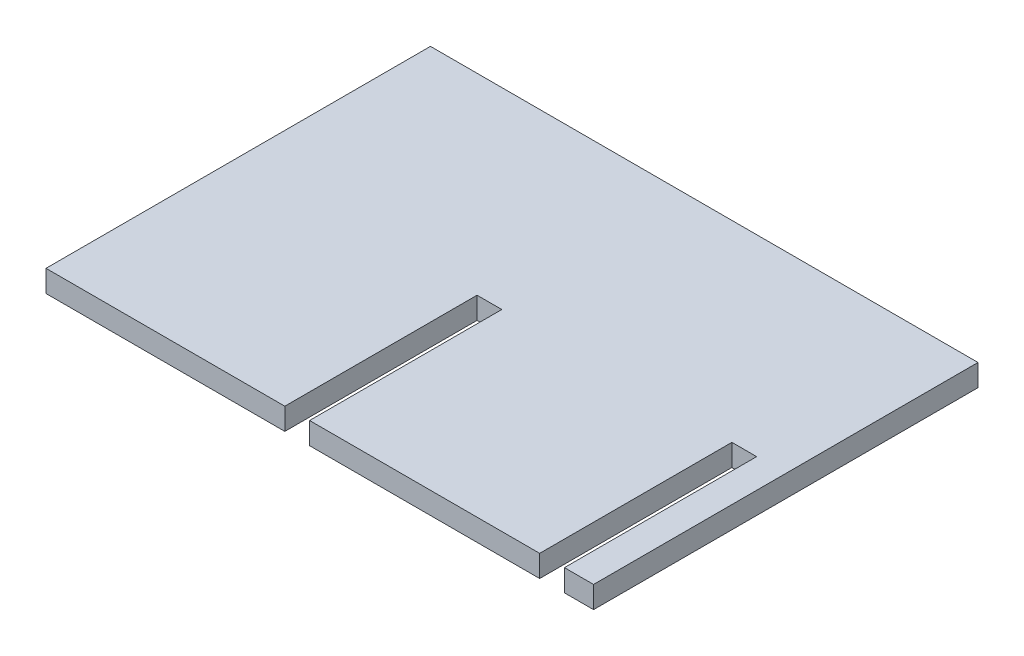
ISO-10303-21;
HEADER;
FILE_DESCRIPTION(('STEP AP214'),'2;1');
FILE_NAME('part.step','',(''),(''),'','','');
FILE_SCHEMA(('AUTOMOTIVE_DESIGN { 1 0 10303 214 1 1 1 1 }'));
ENDSEC;
DATA;
#1=APPLICATION_CONTEXT('core data for automotive mechanical design processes');
#2=APPLICATION_PROTOCOL_DEFINITION('international standard','automotive_design',2000,#1);
#3=PRODUCT_CONTEXT('',#1,'mechanical');
#4=PRODUCT('Part','Part','',(#3));
#5=PRODUCT_RELATED_PRODUCT_CATEGORY('part','',(#4));
#6=PRODUCT_DEFINITION_FORMATION('','',#4);
#7=PRODUCT_DEFINITION_CONTEXT('part definition',#1,'design');
#8=PRODUCT_DEFINITION('design','',#6,#7);
#9=PRODUCT_DEFINITION_SHAPE('','',#8);
#10=(LENGTH_UNIT() NAMED_UNIT(*) SI_UNIT(.MILLI.,.METRE.));
#11=(NAMED_UNIT(*) PLANE_ANGLE_UNIT() SI_UNIT($,.RADIAN.));
#12=(NAMED_UNIT(*) SI_UNIT($,.STERADIAN.) SOLID_ANGLE_UNIT());
#13=UNCERTAINTY_MEASURE_WITH_UNIT(LENGTH_MEASURE(1.E-05),#10,'distance_accuracy_value','');
#14=(GEOMETRIC_REPRESENTATION_CONTEXT(3) GLOBAL_UNCERTAINTY_ASSIGNED_CONTEXT((#13)) GLOBAL_UNIT_ASSIGNED_CONTEXT((#10,
#11,#12)) REPRESENTATION_CONTEXT('',''));
#15=CARTESIAN_POINT('',(0.,0.,0.));
#16=DIRECTION('',(0.,0.,1.));
#17=DIRECTION('',(1.,0.,0.));
#18=AXIS2_PLACEMENT_3D('',#15,#16,#17);
#19=CARTESIAN_POINT('',(0.,0.,26.4));
#20=DIRECTION('',(0.,0.,-1.));
#21=DIRECTION('',(-1.,0.,0.));
#22=AXIS2_PLACEMENT_3D('',#19,#20,#21);
#23=PLANE('',#22);
#24=DIRECTION('',(1.,0.,0.));
#25=VECTOR('',#24,1.);
#26=CARTESIAN_POINT('',(-34.75,-20.75,26.4));
#27=LINE('',#26,#25);
#28=CARTESIAN_POINT('',(0.849999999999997,-20.75,26.4));
#29=VERTEX_POINT('',#28);
#30=CARTESIAN_POINT('',(2.85000000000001,-20.75,26.4));
#31=VERTEX_POINT('',#30);
#32=EDGE_CURVE('E136',#29,#31,#27,.T.);
#33=ORIENTED_EDGE('',*,*,#32,.T.);
#34=DIRECTION('',(0.,-1.,0.));
#35=VECTOR('',#34,1.);
#36=CARTESIAN_POINT('',(2.85000000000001,22.1573664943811,26.4));
#37=LINE('',#36,#35);
#38=CARTESIAN_POINT('',(2.85000000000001,-19.25,26.4));
#39=VERTEX_POINT('',#38);
#40=EDGE_CURVE('E122',#39,#31,#37,.T.);
#41=ORIENTED_EDGE('',*,*,#40,.F.);
#42=DIRECTION('',(-1.,0.,0.));
#43=VECTOR('',#42,1.);
#44=CARTESIAN_POINT('',(-34.75,-19.25,26.4));
#45=LINE('',#44,#43);
#46=CARTESIAN_POINT('',(0.849999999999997,-19.25,26.4));
#47=VERTEX_POINT('',#46);
#48=EDGE_CURVE('E149',#39,#47,#45,.T.);
#49=ORIENTED_EDGE('',*,*,#48,.T.);
#50=DIRECTION('',(0.,-1.,0.));
#51=VECTOR('',#50,1.);
#52=CARTESIAN_POINT('',(0.849999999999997,-5.94098050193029,26.4));
#53=LINE('',#52,#51);
#54=EDGE_CURVE('E143',#47,#29,#53,.T.);
#55=ORIENTED_EDGE('',*,*,#54,.T.);
#56=EDGE_LOOP('',(#33,#41,#49,#55));
#57=FACE_BOUND('',#56,.T.);
#58=ADVANCED_FACE('F34',(#57),#23,.F.);
#59=CARTESIAN_POINT('',(-16.65,-20.75,26.4));
#60=VERTEX_POINT('',#59);
#61=CARTESIAN_POINT('',(-0.850000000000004,-20.75,26.4));
#62=VERTEX_POINT('',#61);
#63=EDGE_CURVE('E144',#60,#62,#27,.T.);
#64=ORIENTED_EDGE('',*,*,#63,.T.);
#65=DIRECTION('',(0.,-1.,0.));
#66=VECTOR('',#65,1.);
#67=CARTESIAN_POINT('',(-0.850000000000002,-5.94098050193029,26.4));
#68=LINE('',#67,#66);
#69=CARTESIAN_POINT('',(-0.850000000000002,-19.25,26.4));
#70=VERTEX_POINT('',#69);
#71=EDGE_CURVE('E57',#70,#62,#68,.T.);
#72=ORIENTED_EDGE('',*,*,#71,.F.);
#73=CARTESIAN_POINT('',(-16.65,-19.25,26.4));
#74=VERTEX_POINT('',#73);
#75=EDGE_CURVE('E195',#70,#74,#45,.T.);
#76=ORIENTED_EDGE('',*,*,#75,.T.);
#77=DIRECTION('',(0.,-1.,0.));
#78=VECTOR('',#77,1.);
#79=CARTESIAN_POINT('',(-16.65,-5.94098050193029,26.4));
#80=LINE('',#79,#78);
#81=EDGE_CURVE('E186',#74,#60,#80,.T.);
#82=ORIENTED_EDGE('',*,*,#81,.T.);
#83=EDGE_LOOP('',(#64,#72,#76,#82));
#84=FACE_BOUND('',#83,.T.);
#85=ADVANCED_FACE('F204',(#84),#23,.F.);
#86=CARTESIAN_POINT('',(-34.75,-19.25,26.4));
#87=DIRECTION('',(0.,-1.,0.));
#88=DIRECTION('',(0.,0.,-1.));
#89=AXIS2_PLACEMENT_3D('',#86,#87,#88);
#90=PLANE('',#89);
#91=ORIENTED_EDGE('',*,*,#48,.F.);
#92=DIRECTION('',(0.,0.,1.));
#93=VECTOR('',#92,1.);
#94=CARTESIAN_POINT('',(2.85000000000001,-19.25,26.4));
#95=LINE('',#94,#93);
#96=CARTESIAN_POINT('',(2.85000000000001,-19.25,0.));
#97=VERTEX_POINT('',#96);
#98=EDGE_CURVE('E125',#97,#39,#95,.T.);
#99=ORIENTED_EDGE('',*,*,#98,.F.);
#100=DIRECTION('',(-1.,0.,0.));
#101=VECTOR('',#100,1.);
#102=CARTESIAN_POINT('',(-34.75,-19.25,0.));
#103=LINE('',#102,#101);
#104=CARTESIAN_POINT('',(-34.75,-19.25,0.));
#105=VERTEX_POINT('',#104);
#106=EDGE_CURVE('E161',#97,#105,#103,.T.);
#107=ORIENTED_EDGE('',*,*,#106,.T.);
#108=DIRECTION('',(0.,0.,-1.));
#109=VECTOR('',#108,1.);
#110=CARTESIAN_POINT('',(-34.75,-19.25,26.4));
#111=LINE('',#110,#109);
#112=CARTESIAN_POINT('',(-34.75,-19.25,26.4));
#113=VERTEX_POINT('',#112);
#114=EDGE_CURVE('E11',#113,#105,#111,.T.);
#115=ORIENTED_EDGE('',*,*,#114,.F.);
#116=CARTESIAN_POINT('',(-18.35,-19.25,26.4));
#117=VERTEX_POINT('',#116);
#118=EDGE_CURVE('E159',#117,#113,#45,.T.);
#119=ORIENTED_EDGE('',*,*,#118,.F.);
#120=DIRECTION('',(0.,0.,1.));
#121=VECTOR('',#120,1.);
#122=CARTESIAN_POINT('',(-18.35,-19.25,13.2));
#123=LINE('',#122,#121);
#124=CARTESIAN_POINT('',(-18.35,-19.25,13.2));
#125=VERTEX_POINT('',#124);
#126=EDGE_CURVE('E173',#125,#117,#123,.T.);
#127=ORIENTED_EDGE('',*,*,#126,.F.);
#128=DIRECTION('',(-1.,0.,0.));
#129=VECTOR('',#128,1.);
#130=CARTESIAN_POINT('',(-18.35,-19.25,13.2));
#131=LINE('',#130,#129);
#132=CARTESIAN_POINT('',(-16.65,-19.25,13.2));
#133=VERTEX_POINT('',#132);
#134=EDGE_CURVE('E167',#133,#125,#131,.T.);
#135=ORIENTED_EDGE('',*,*,#134,.F.);
#136=DIRECTION('',(0.,0.,-1.));
#137=VECTOR('',#136,1.);
#138=CARTESIAN_POINT('',(-16.65,-19.25,13.2));
#139=LINE('',#138,#137);
#140=EDGE_CURVE('E162',#74,#133,#139,.T.);
#141=ORIENTED_EDGE('',*,*,#140,.F.);
#142=ORIENTED_EDGE('',*,*,#75,.F.);
#143=DIRECTION('',(0.,0.,1.));
#144=VECTOR('',#143,1.);
#145=CARTESIAN_POINT('',(-0.850000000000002,-19.25,26.4));
#146=LINE('',#145,#144);
#147=CARTESIAN_POINT('',(-0.85,-19.25,13.2));
#148=VERTEX_POINT('',#147);
#149=EDGE_CURVE('E325',#148,#70,#146,.T.);
#150=ORIENTED_EDGE('',*,*,#149,.F.);
#151=DIRECTION('',(-1.,0.,0.));
#152=VECTOR('',#151,1.);
#153=CARTESIAN_POINT('',(0.85,-19.25,13.2));
#154=LINE('',#153,#152);
#155=CARTESIAN_POINT('',(0.85,-19.25,13.2));
#156=VERTEX_POINT('',#155);
#157=EDGE_CURVE('E329',#156,#148,#154,.T.);
#158=ORIENTED_EDGE('',*,*,#157,.F.);
#159=DIRECTION('',(0.,0.,-1.));
#160=VECTOR('',#159,1.);
#161=CARTESIAN_POINT('',(0.849999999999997,-19.25,26.4));
#162=LINE('',#161,#160);
#163=EDGE_CURVE('E180',#47,#156,#162,.T.);
#164=ORIENTED_EDGE('',*,*,#163,.F.);
#165=EDGE_LOOP('',(#91,#99,#107,#115,#119,#127,#135,#141,#142,#150,#158,#164));
#166=FACE_BOUND('',#165,.T.);
#167=ADVANCED_FACE('F36',(#166),#90,.F.);
#168=CARTESIAN_POINT('',(-34.75,-19.25,26.4));
#169=DIRECTION('',(1.,0.,0.));
#170=DIRECTION('',(0.,0.,-1.));
#171=AXIS2_PLACEMENT_3D('',#168,#169,#170);
#172=PLANE('',#171);
#173=DIRECTION('',(0.,-1.,0.));
#174=VECTOR('',#173,1.);
#175=CARTESIAN_POINT('',(-34.75,-19.25,0.));
#176=LINE('',#175,#174);
#177=CARTESIAN_POINT('',(-34.75,-20.75,0.));
#178=VERTEX_POINT('',#177);
#179=EDGE_CURVE('E160',#105,#178,#176,.T.);
#180=ORIENTED_EDGE('',*,*,#179,.T.);
#181=DIRECTION('',(0.,0.,-1.));
#182=VECTOR('',#181,1.);
#183=CARTESIAN_POINT('',(-34.75,-20.75,26.4));
#184=LINE('',#183,#182);
#185=CARTESIAN_POINT('',(-34.75,-20.75,26.4));
#186=VERTEX_POINT('',#185);
#187=EDGE_CURVE('E42',#186,#178,#184,.T.);
#188=ORIENTED_EDGE('',*,*,#187,.F.);
#189=DIRECTION('',(0.,-1.,0.));
#190=VECTOR('',#189,1.);
#191=CARTESIAN_POINT('',(-34.75,-19.25,26.4));
#192=LINE('',#191,#190);
#193=EDGE_CURVE('E145',#113,#186,#192,.T.);
#194=ORIENTED_EDGE('',*,*,#193,.F.);
#195=ORIENTED_EDGE('',*,*,#114,.T.);
#196=EDGE_LOOP('',(#180,#188,#194,#195));
#197=FACE_BOUND('',#196,.T.);
#198=ADVANCED_FACE('F201',(#197),#172,.F.);
#199=CARTESIAN_POINT('',(-34.75,-20.75,26.4));
#200=DIRECTION('',(0.,1.,0.));
#201=DIRECTION('',(0.,0.,1.));
#202=AXIS2_PLACEMENT_3D('',#199,#200,#201);
#203=PLANE('',#202);
#204=DIRECTION('',(1.,0.,0.));
#205=VECTOR('',#204,1.);
#206=CARTESIAN_POINT('',(-34.75,-20.75,0.));
#207=LINE('',#206,#205);
#208=CARTESIAN_POINT('',(2.85000000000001,-20.75,0.));
#209=VERTEX_POINT('',#208);
#210=EDGE_CURVE('E139',#178,#209,#207,.T.);
#211=ORIENTED_EDGE('',*,*,#210,.T.);
#212=DIRECTION('',(0.,0.,-1.));
#213=VECTOR('',#212,1.);
#214=CARTESIAN_POINT('',(2.85000000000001,-20.75,26.4));
#215=LINE('',#214,#213);
#216=EDGE_CURVE('E49',#31,#209,#215,.T.);
#217=ORIENTED_EDGE('',*,*,#216,.F.);
#218=ORIENTED_EDGE('',*,*,#32,.F.);
#219=DIRECTION('',(0.,0.,1.));
#220=VECTOR('',#219,1.);
#221=CARTESIAN_POINT('',(0.849999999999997,-20.75,26.4));
#222=LINE('',#221,#220);
#223=CARTESIAN_POINT('',(0.85,-20.75,13.2));
#224=VERTEX_POINT('',#223);
#225=EDGE_CURVE('E343',#224,#29,#222,.T.);
#226=ORIENTED_EDGE('',*,*,#225,.F.);
#227=DIRECTION('',(1.,0.,0.));
#228=VECTOR('',#227,1.);
#229=CARTESIAN_POINT('',(0.85,-20.75,13.2));
#230=LINE('',#229,#228);
#231=CARTESIAN_POINT('',(-0.85,-20.75,13.2));
#232=VERTEX_POINT('',#231);
#233=EDGE_CURVE('E342',#232,#224,#230,.T.);
#234=ORIENTED_EDGE('',*,*,#233,.F.);
#235=DIRECTION('',(0.,0.,-1.));
#236=VECTOR('',#235,1.);
#237=CARTESIAN_POINT('',(-0.850000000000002,-20.75,26.4));
#238=LINE('',#237,#236);
#239=EDGE_CURVE('E340',#62,#232,#238,.T.);
#240=ORIENTED_EDGE('',*,*,#239,.F.);
#241=ORIENTED_EDGE('',*,*,#63,.F.);
#242=DIRECTION('',(0.,0.,1.));
#243=VECTOR('',#242,1.);
#244=CARTESIAN_POINT('',(-16.65,-20.75,13.2));
#245=LINE('',#244,#243);
#246=CARTESIAN_POINT('',(-16.65,-20.75,13.2));
#247=VERTEX_POINT('',#246);
#248=EDGE_CURVE('E177',#247,#60,#245,.T.);
#249=ORIENTED_EDGE('',*,*,#248,.F.);
#250=DIRECTION('',(1.,0.,0.));
#251=VECTOR('',#250,1.);
#252=CARTESIAN_POINT('',(-18.35,-20.75,13.2));
#253=LINE('',#252,#251);
#254=CARTESIAN_POINT('',(-18.35,-20.75,13.2));
#255=VERTEX_POINT('',#254);
#256=EDGE_CURVE('E183',#255,#247,#253,.T.);
#257=ORIENTED_EDGE('',*,*,#256,.F.);
#258=DIRECTION('',(0.,0.,-1.));
#259=VECTOR('',#258,1.);
#260=CARTESIAN_POINT('',(-18.35,-20.75,13.2));
#261=LINE('',#260,#259);
#262=CARTESIAN_POINT('',(-18.35,-20.75,26.4));
#263=VERTEX_POINT('',#262);
#264=EDGE_CURVE('E179',#263,#255,#261,.T.);
#265=ORIENTED_EDGE('',*,*,#264,.F.);
#266=EDGE_CURVE('E147',#186,#263,#27,.T.);
#267=ORIENTED_EDGE('',*,*,#266,.F.);
#268=ORIENTED_EDGE('',*,*,#187,.T.);
#269=EDGE_LOOP('',(#211,#217,#218,#226,#234,#240,#241,#249,#257,#265,#267,#268));
#270=FACE_BOUND('',#269,.T.);
#271=ADVANCED_FACE('F134',(#270),#203,.F.);
#272=ORIENTED_EDGE('',*,*,#266,.T.);
#273=DIRECTION('',(0.,-1.,0.));
#274=VECTOR('',#273,1.);
#275=CARTESIAN_POINT('',(-18.35,-5.94098050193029,26.4));
#276=LINE('',#275,#274);
#277=EDGE_CURVE('E191',#117,#263,#276,.T.);
#278=ORIENTED_EDGE('',*,*,#277,.F.);
#279=ORIENTED_EDGE('',*,*,#118,.T.);
#280=ORIENTED_EDGE('',*,*,#193,.T.);
#281=EDGE_LOOP('',(#272,#278,#279,#280));
#282=FACE_BOUND('',#281,.T.);
#283=ADVANCED_FACE('F198',(#282),#23,.F.);
#284=CARTESIAN_POINT('',(0.,0.,0.));
#285=DIRECTION('',(0.,0.,-1.));
#286=DIRECTION('',(-1.,0.,0.));
#287=AXIS2_PLACEMENT_3D('',#284,#285,#286);
#288=PLANE('',#287);
#289=DIRECTION('',(0.,-1.,0.));
#290=VECTOR('',#289,1.);
#291=CARTESIAN_POINT('',(2.85000000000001,22.1573664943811,0.));
#292=LINE('',#291,#290);
#293=EDGE_CURVE('E129',#97,#209,#292,.T.);
#294=ORIENTED_EDGE('',*,*,#293,.T.);
#295=ORIENTED_EDGE('',*,*,#210,.F.);
#296=ORIENTED_EDGE('',*,*,#179,.F.);
#297=ORIENTED_EDGE('',*,*,#106,.F.);
#298=EDGE_LOOP('',(#294,#295,#296,#297));
#299=FACE_BOUND('',#298,.T.);
#300=ADVANCED_FACE('F217',(#299),#288,.T.);
#301=CARTESIAN_POINT('',(-16.65,-5.94098050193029,13.2));
#302=DIRECTION('',(1.,0.,0.));
#303=DIRECTION('',(0.,0.,-1.));
#304=AXIS2_PLACEMENT_3D('',#301,#302,#303);
#305=PLANE('',#304);
#306=ORIENTED_EDGE('',*,*,#140,.T.);
#307=DIRECTION('',(0.,-1.,0.));
#308=VECTOR('',#307,1.);
#309=CARTESIAN_POINT('',(-16.65,-5.94098050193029,13.2));
#310=LINE('',#309,#308);
#311=EDGE_CURVE('E187',#133,#247,#310,.T.);
#312=ORIENTED_EDGE('',*,*,#311,.T.);
#313=ORIENTED_EDGE('',*,*,#248,.T.);
#314=ORIENTED_EDGE('',*,*,#81,.F.);
#315=EDGE_LOOP('',(#306,#312,#313,#314));
#316=FACE_BOUND('',#315,.T.);
#317=ADVANCED_FACE('F222',(#316),#305,.F.);
#318=CARTESIAN_POINT('',(-18.35,-5.94098050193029,13.2));
#319=DIRECTION('',(0.,0.,-1.));
#320=DIRECTION('',(-1.,0.,0.));
#321=AXIS2_PLACEMENT_3D('',#318,#319,#320);
#322=PLANE('',#321);
#323=ORIENTED_EDGE('',*,*,#134,.T.);
#324=DIRECTION('',(0.,-1.,0.));
#325=VECTOR('',#324,1.);
#326=CARTESIAN_POINT('',(-18.35,-5.94098050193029,13.2));
#327=LINE('',#326,#325);
#328=EDGE_CURVE('E189',#125,#255,#327,.T.);
#329=ORIENTED_EDGE('',*,*,#328,.T.);
#330=ORIENTED_EDGE('',*,*,#256,.T.);
#331=ORIENTED_EDGE('',*,*,#311,.F.);
#332=EDGE_LOOP('',(#323,#329,#330,#331));
#333=FACE_BOUND('',#332,.T.);
#334=ADVANCED_FACE('F254',(#333),#322,.F.);
#335=CARTESIAN_POINT('',(-18.35,-5.94098050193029,13.2));
#336=DIRECTION('',(-1.,0.,0.));
#337=DIRECTION('',(0.,0.,1.));
#338=AXIS2_PLACEMENT_3D('',#335,#336,#337);
#339=PLANE('',#338);
#340=ORIENTED_EDGE('',*,*,#126,.T.);
#341=ORIENTED_EDGE('',*,*,#277,.T.);
#342=ORIENTED_EDGE('',*,*,#264,.T.);
#343=ORIENTED_EDGE('',*,*,#328,.F.);
#344=EDGE_LOOP('',(#340,#341,#342,#343));
#345=FACE_BOUND('',#344,.T.);
#346=ADVANCED_FACE('F262',(#345),#339,.F.);
#347=CARTESIAN_POINT('',(0.849999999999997,-5.94098050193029,26.4));
#348=DIRECTION('',(1.,0.,0.));
#349=DIRECTION('',(0.,0.,-1.));
#350=AXIS2_PLACEMENT_3D('',#347,#348,#349);
#351=PLANE('',#350);
#352=ORIENTED_EDGE('',*,*,#163,.T.);
#353=DIRECTION('',(0.,-1.,0.));
#354=VECTOR('',#353,1.);
#355=CARTESIAN_POINT('',(0.85,-5.94098050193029,13.2));
#356=LINE('',#355,#354);
#357=EDGE_CURVE('E330',#156,#224,#356,.T.);
#358=ORIENTED_EDGE('',*,*,#357,.T.);
#359=ORIENTED_EDGE('',*,*,#225,.T.);
#360=ORIENTED_EDGE('',*,*,#54,.F.);
#361=EDGE_LOOP('',(#352,#358,#359,#360));
#362=FACE_BOUND('',#361,.T.);
#363=ADVANCED_FACE('F272',(#362),#351,.F.);
#364=CARTESIAN_POINT('',(0.85,-5.94098050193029,13.2));
#365=DIRECTION('',(0.,0.,-1.));
#366=DIRECTION('',(-1.,0.,0.));
#367=AXIS2_PLACEMENT_3D('',#364,#365,#366);
#368=PLANE('',#367);
#369=ORIENTED_EDGE('',*,*,#157,.T.);
#370=DIRECTION('',(0.,-1.,0.));
#371=VECTOR('',#370,1.);
#372=CARTESIAN_POINT('',(-0.85,-5.94098050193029,13.2));
#373=LINE('',#372,#371);
#374=EDGE_CURVE('E326',#148,#232,#373,.T.);
#375=ORIENTED_EDGE('',*,*,#374,.T.);
#376=ORIENTED_EDGE('',*,*,#233,.T.);
#377=ORIENTED_EDGE('',*,*,#357,.F.);
#378=EDGE_LOOP('',(#369,#375,#376,#377));
#379=FACE_BOUND('',#378,.T.);
#380=ADVANCED_FACE('F282',(#379),#368,.F.);
#381=CARTESIAN_POINT('',(-0.850000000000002,-5.94098050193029,26.4));
#382=DIRECTION('',(-1.,0.,0.));
#383=DIRECTION('',(0.,0.,1.));
#384=AXIS2_PLACEMENT_3D('',#381,#382,#383);
#385=PLANE('',#384);
#386=ORIENTED_EDGE('',*,*,#149,.T.);
#387=ORIENTED_EDGE('',*,*,#71,.T.);
#388=ORIENTED_EDGE('',*,*,#239,.T.);
#389=ORIENTED_EDGE('',*,*,#374,.F.);
#390=EDGE_LOOP('',(#386,#387,#388,#389));
#391=FACE_BOUND('',#390,.T.);
#392=ADVANCED_FACE('F292',(#391),#385,.F.);
#393=CARTESIAN_POINT('',(2.85000000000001,22.1573664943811,26.4));
#394=DIRECTION('',(-1.,0.,0.));
#395=DIRECTION('',(0.,0.,1.));
#396=AXIS2_PLACEMENT_3D('',#393,#394,#395);
#397=PLANE('',#396);
#398=ORIENTED_EDGE('',*,*,#98,.T.);
#399=ORIENTED_EDGE('',*,*,#40,.T.);
#400=ORIENTED_EDGE('',*,*,#216,.T.);
#401=ORIENTED_EDGE('',*,*,#293,.F.);
#402=EDGE_LOOP('',(#398,#399,#400,#401));
#403=FACE_BOUND('',#402,.T.);
#404=ADVANCED_FACE('F123',(#403),#397,.F.);
#405=CLOSED_SHELL('',(#58,#85,#167,#198,#271,#283,#300,#317,#334,#346,#363,#380,#392,#404));
#406=MANIFOLD_SOLID_BREP('B2',#405);
#407=ADVANCED_BREP_SHAPE_REPRESENTATION('',(#18,#406),#14);
#408=SHAPE_DEFINITION_REPRESENTATION(#9,#407);
ENDSEC;
END-ISO-10303-21;
